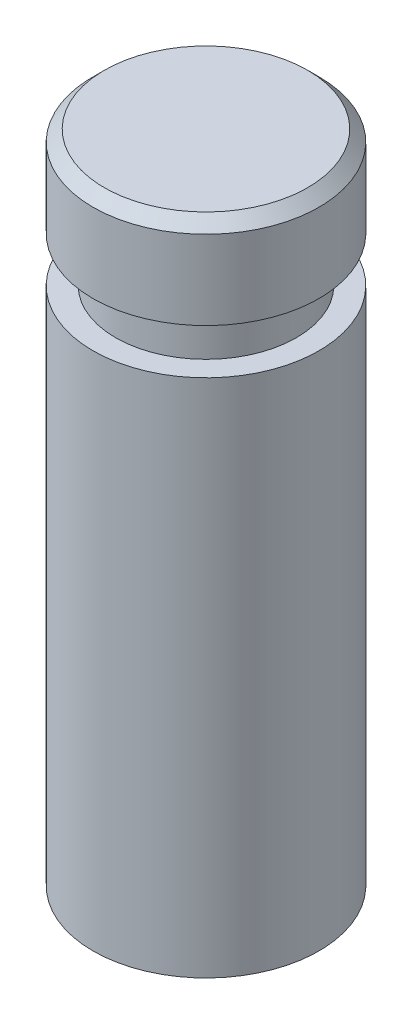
ISO-10303-21;
HEADER;
FILE_DESCRIPTION(('STEP AP214'),'2;1');
FILE_NAME('part.step','',(''),(''),'','','');
FILE_SCHEMA(('AUTOMOTIVE_DESIGN { 1 0 10303 214 1 1 1 1 }'));
ENDSEC;
DATA;
#1=APPLICATION_CONTEXT('core data for automotive mechanical design processes');
#2=APPLICATION_PROTOCOL_DEFINITION('international standard','automotive_design',2000,#1);
#3=PRODUCT_CONTEXT('',#1,'mechanical');
#4=PRODUCT('Part','Part','',(#3));
#5=PRODUCT_RELATED_PRODUCT_CATEGORY('part','',(#4));
#6=PRODUCT_DEFINITION_FORMATION('','',#4);
#7=PRODUCT_DEFINITION_CONTEXT('part definition',#1,'design');
#8=PRODUCT_DEFINITION('design','',#6,#7);
#9=PRODUCT_DEFINITION_SHAPE('','',#8);
#10=(LENGTH_UNIT() NAMED_UNIT(*) SI_UNIT(.MILLI.,.METRE.));
#11=(NAMED_UNIT(*) PLANE_ANGLE_UNIT() SI_UNIT($,.RADIAN.));
#12=(NAMED_UNIT(*) SI_UNIT($,.STERADIAN.) SOLID_ANGLE_UNIT());
#13=UNCERTAINTY_MEASURE_WITH_UNIT(LENGTH_MEASURE(1.E-05),#10,'distance_accuracy_value','');
#14=(GEOMETRIC_REPRESENTATION_CONTEXT(3) GLOBAL_UNCERTAINTY_ASSIGNED_CONTEXT((#13)) GLOBAL_UNIT_ASSIGNED_CONTEXT((#10,
#11,#12)) REPRESENTATION_CONTEXT('',''));
#15=CARTESIAN_POINT('',(0.,0.,0.));
#16=DIRECTION('',(0.,0.,1.));
#17=DIRECTION('',(1.,0.,0.));
#18=AXIS2_PLACEMENT_3D('',#15,#16,#17);
#19=CARTESIAN_POINT('',(10.,0.,0.));
#20=DIRECTION('',(0.,1.,0.));
#21=DIRECTION('',(0.,0.,1.));
#22=AXIS2_PLACEMENT_3D('',#19,#20,#21);
#23=PLANE('',#22);
#24=CARTESIAN_POINT('',(0.,0.,0.));
#25=DIRECTION('',(0.,1.,0.));
#26=DIRECTION('',(0.,0.,1.));
#27=AXIS2_PLACEMENT_3D('',#24,#25,#26);
#28=CIRCLE('',#27,10.);
#29=CARTESIAN_POINT('',(0.,0.,10.));
#30=VERTEX_POINT('',#29);
#31=EDGE_CURVE('E54',#30,#30,#28,.T.);
#32=ORIENTED_EDGE('',*,*,#31,.F.);
#33=EDGE_LOOP('',(#32));
#34=FACE_BOUND('',#33,.T.);
#35=ADVANCED_FACE('F29',(#34),#23,.F.);
#36=CARTESIAN_POINT('',(0.,58.,0.));
#37=DIRECTION('',(0.,-1.,0.));
#38=DIRECTION('',(0.,0.,-1.));
#39=AXIS2_PLACEMENT_3D('',#36,#37,#38);
#40=PLANE('',#39);
#41=CARTESIAN_POINT('',(0.,58.,0.));
#42=DIRECTION('',(0.,-1.,0.));
#43=DIRECTION('',(0.,0.,-1.));
#44=AXIS2_PLACEMENT_3D('',#41,#42,#43);
#45=CIRCLE('',#44,9.00000000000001);
#46=CARTESIAN_POINT('',(0.,58.,-9.00000000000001));
#47=VERTEX_POINT('',#46);
#48=EDGE_CURVE('E35',#47,#47,#45,.F.);
#49=ORIENTED_EDGE('',*,*,#48,.T.);
#50=EDGE_LOOP('',(#49));
#51=FACE_BOUND('',#50,.T.);
#52=ADVANCED_FACE('F61',(#51),#40,.F.);
#53=CARTESIAN_POINT('',(0.,63.2831764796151,0.));
#54=DIRECTION('',(0.,1.,0.));
#55=DIRECTION('',(0.,0.,1.));
#56=AXIS2_PLACEMENT_3D('',#53,#54,#55);
#57=CYLINDRICAL_SURFACE('',#56,10.);
#58=CARTESIAN_POINT('',(0.,57.,0.));
#59=DIRECTION('',(0.,-1.,0.));
#60=DIRECTION('',(0.,0.,-1.));
#61=AXIS2_PLACEMENT_3D('',#58,#59,#60);
#62=CIRCLE('',#61,10.);
#63=CARTESIAN_POINT('',(0.,57.,-10.));
#64=VERTEX_POINT('',#63);
#65=EDGE_CURVE('E10',#64,#64,#62,.T.);
#66=ORIENTED_EDGE('',*,*,#65,.T.);
#67=EDGE_LOOP('',(#66));
#68=FACE_BOUND('',#67,.T.);
#69=CARTESIAN_POINT('',(0.,50.,0.));
#70=DIRECTION('',(0.,1.,0.));
#71=DIRECTION('',(0.,0.,1.));
#72=AXIS2_PLACEMENT_3D('',#69,#70,#71);
#73=CIRCLE('',#72,10.);
#74=CARTESIAN_POINT('',(0.,50.,10.));
#75=VERTEX_POINT('',#74);
#76=EDGE_CURVE('E39',#75,#75,#73,.T.);
#77=ORIENTED_EDGE('',*,*,#76,.T.);
#78=EDGE_LOOP('',(#77));
#79=FACE_BOUND('',#78,.T.);
#80=ADVANCED_FACE('F65',(#68,#79),#57,.T.);
#81=CARTESIAN_POINT('',(10.,50.,0.));
#82=DIRECTION('',(0.,1.,0.));
#83=DIRECTION('',(0.,0.,1.));
#84=AXIS2_PLACEMENT_3D('',#81,#82,#83);
#85=PLANE('',#84);
#86=ORIENTED_EDGE('',*,*,#76,.F.);
#87=EDGE_LOOP('',(#86));
#88=FACE_BOUND('',#87,.T.);
#89=CARTESIAN_POINT('',(0.,50.,0.));
#90=DIRECTION('',(0.,1.,0.));
#91=DIRECTION('',(0.,0.,1.));
#92=AXIS2_PLACEMENT_3D('',#89,#90,#91);
#93=CIRCLE('',#92,8.);
#94=CARTESIAN_POINT('',(0.,50.,8.));
#95=VERTEX_POINT('',#94);
#96=EDGE_CURVE('E43',#95,#95,#93,.T.);
#97=ORIENTED_EDGE('',*,*,#96,.T.);
#98=EDGE_LOOP('',(#97));
#99=FACE_BOUND('',#98,.T.);
#100=ADVANCED_FACE('F69',(#88,#99),#85,.F.);
#101=CARTESIAN_POINT('',(0.,63.2831764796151,0.));
#102=DIRECTION('',(0.,1.,0.));
#103=DIRECTION('',(0.,0.,1.));
#104=AXIS2_PLACEMENT_3D('',#101,#102,#103);
#105=CYLINDRICAL_SURFACE('',#104,8.);
#106=ORIENTED_EDGE('',*,*,#96,.F.);
#107=EDGE_LOOP('',(#106));
#108=FACE_BOUND('',#107,.T.);
#109=CARTESIAN_POINT('',(0.,46.,0.));
#110=DIRECTION('',(0.,1.,0.));
#111=DIRECTION('',(0.,0.,1.));
#112=AXIS2_PLACEMENT_3D('',#109,#110,#111);
#113=CIRCLE('',#112,8.);
#114=CARTESIAN_POINT('',(0.,46.,8.));
#115=VERTEX_POINT('',#114);
#116=EDGE_CURVE('E48',#115,#115,#113,.T.);
#117=ORIENTED_EDGE('',*,*,#116,.T.);
#118=EDGE_LOOP('',(#117));
#119=FACE_BOUND('',#118,.T.);
#120=ADVANCED_FACE('F74',(#108,#119),#105,.T.);
#121=CARTESIAN_POINT('',(8.,46.,0.));
#122=DIRECTION('',(0.,-1.,0.));
#123=DIRECTION('',(0.,0.,-1.));
#124=AXIS2_PLACEMENT_3D('',#121,#122,#123);
#125=PLANE('',#124);
#126=ORIENTED_EDGE('',*,*,#116,.F.);
#127=EDGE_LOOP('',(#126));
#128=FACE_BOUND('',#127,.T.);
#129=CARTESIAN_POINT('',(0.,46.,0.));
#130=DIRECTION('',(0.,1.,0.));
#131=DIRECTION('',(0.,0.,1.));
#132=AXIS2_PLACEMENT_3D('',#129,#130,#131);
#133=CIRCLE('',#132,10.);
#134=CARTESIAN_POINT('',(0.,46.,10.));
#135=VERTEX_POINT('',#134);
#136=EDGE_CURVE('E51',#135,#135,#133,.T.);
#137=ORIENTED_EDGE('',*,*,#136,.T.);
#138=EDGE_LOOP('',(#137));
#139=FACE_BOUND('',#138,.T.);
#140=ADVANCED_FACE('F78',(#128,#139),#125,.F.);
#141=CARTESIAN_POINT('',(0.,63.2831764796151,0.));
#142=DIRECTION('',(0.,1.,0.));
#143=DIRECTION('',(0.,0.,1.));
#144=AXIS2_PLACEMENT_3D('',#141,#142,#143);
#145=CYLINDRICAL_SURFACE('',#144,10.);
#146=ORIENTED_EDGE('',*,*,#136,.F.);
#147=EDGE_LOOP('',(#146));
#148=FACE_BOUND('',#147,.T.);
#149=ORIENTED_EDGE('',*,*,#31,.T.);
#150=EDGE_LOOP('',(#149));
#151=FACE_BOUND('',#150,.T.);
#152=ADVANCED_FACE('F58',(#148,#151),#145,.T.);
#153=CARTESIAN_POINT('',(0.,58.,0.));
#154=DIRECTION('',(0.,-1.,0.));
#155=DIRECTION('',(0.,0.,-1.));
#156=AXIS2_PLACEMENT_3D('',#153,#154,#155);
#157=CONICAL_SURFACE('',#156,9.00000000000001,0.785398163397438);
#158=ORIENTED_EDGE('',*,*,#65,.F.);
#159=EDGE_LOOP('',(#158));
#160=FACE_BOUND('',#159,.T.);
#161=ORIENTED_EDGE('',*,*,#48,.F.);
#162=EDGE_LOOP('',(#161));
#163=FACE_BOUND('',#162,.T.);
#164=ADVANCED_FACE('F85',(#160,#163),#157,.T.);
#165=CLOSED_SHELL('',(#35,#52,#80,#100,#120,#140,#152,#164));
#166=MANIFOLD_SOLID_BREP('B2',#165);
#167=ADVANCED_BREP_SHAPE_REPRESENTATION('',(#18,#166),#14);
#168=SHAPE_DEFINITION_REPRESENTATION(#9,#167);
ENDSEC;
END-ISO-10303-21;
